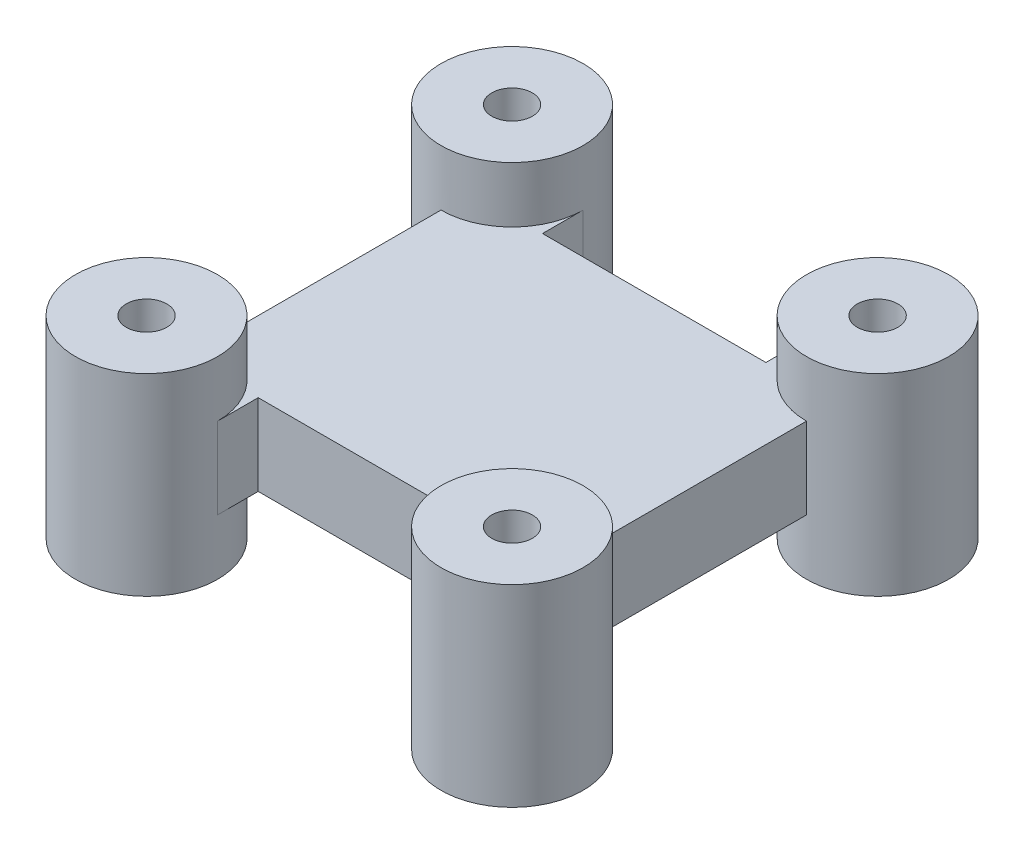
from build123d import *

# Parameters (mm, degrees)
SKETCH1_W           = 22
SKETCH1_H           = 28
BOSS_EXTRUDE1_DEPTH = 8
SKETCH2_R           = 2
CUT_EXTRUDE1_DEPTH  = 37.249137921
SKETCH5_R           = 7
SKETCH5_R_2         = 2
BOSS_EXTRUDE3_DEPTH = 5.5


with BuildPart() as part:
    # Sketch1 → Boss-Extrude1 (new body)
    with BuildSketch(Plane(origin=(0, 0, 0), x_dir=(1, 0, 0), z_dir=(0, 1, 0))):
        with BuildLine():
            ThreePointArc((-18, 11), (-13.050252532, 13.050252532), (-11, 18))
            Line((-11, 18), (-18, 18))
            Line((-18, 18), (-18, 11))
        make_face()
        with BuildLine():
            Line((-18, 18), (-11, 18))
            ThreePointArc((-11, 18), (-22.949747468, 22.949747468), (-18, 11))
            Line((-18, 11), (-18, 18))
        make_face()
        with BuildLine():
            ThreePointArc((-18, 11), (-13.050252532, 13.050252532), (-11, 18))
            Line((-11, 18), (-18, 18))
            Line((-18, 18), (-18, 11))
        make_face()
        with BuildLine():
            Line((-18, 18), (-11, 18))
            ThreePointArc((-11, 18), (-22.949747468, 22.949747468), (-18, 11))
            Line((-18, 11), (-18, 18))
        make_face()
        with BuildLine():
            Line((-11, -18), (-11, -14))
            Line((-11, -14), (-11, 14))
            Line((-11, 14), (-11, 18))
            ThreePointArc((-11, 18), (-13.050252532, 13.050252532), (-18, 11))
            Line((-18, 11), (-18, -11))
            ThreePointArc((-18, -11), (-13.050252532, -13.050252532), (-11, -18))
        make_face()
        with BuildLine():
            ThreePointArc((-18, -11), (-22.949747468, -22.949747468), (-11, -18))
            Line((-11, -18), (-18, -18))
            Line((-18, -18), (-18, -11))
        make_face()
        with BuildLine():
            Line((-18, -18), (-11, -18))
            ThreePointArc((-11, -18), (-13.050252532, -13.050252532), (-18, -11))
            Line((-18, -11), (-18, -18))
        make_face()
        with BuildLine():
            ThreePointArc((-18, -11), (-22.949747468, -22.949747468), (-11, -18))
            Line((-11, -18), (-18, -18))
            Line((-18, -18), (-18, -11))
        make_face()
        with BuildLine():
            Line((-18, -18), (-11, -18))
            ThreePointArc((-11, -18), (-13.050252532, -13.050252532), (-18, -11))
            Line((-18, -11), (-18, -18))
        make_face()
        Rectangle(SKETCH1_W, SKETCH1_H)
        with BuildLine():
            ThreePointArc((18, -11), (13.050252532, -13.050252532), (11, -18))
            Line((11, -18), (18, -18))
            Line((18, -18), (18, -11))
        make_face()
        with BuildLine():
            Line((18, -18), (11, -18))
            ThreePointArc((11, -18), (18, -25), (25, -18))
            ThreePointArc((25, -18), (22.949747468, -13.050252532), (18, -11))
            Line((18, -11), (18, -18))
        make_face()
        with BuildLine():
            Line((11, 14), (11, -14))
            Line((11, -14), (11, -18))
            ThreePointArc((11, -18), (13.050252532, -13.050252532), (18, -11))
            Line((18, -11), (18, 11))
            ThreePointArc((18, 11), (13.050252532, 13.050252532), (11, 18))
            Line((11, 18), (11, 14))
        make_face()
        with BuildLine():
            ThreePointArc((25, 18), (18, 25), (11, 18))
            Line((11, 18), (18, 18))
            Line((18, 18), (18, 11))
            ThreePointArc((18, 11), (22.949747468, 13.050252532), (25, 18))
        make_face()
        with BuildLine():
            Line((18, 18), (11, 18))
            ThreePointArc((11, 18), (13.050252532, 13.050252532), (18, 11))
            Line((18, 11), (18, 18))
        make_face()
        with BuildLine():
            ThreePointArc((25, 18), (18, 25), (11, 18))
            Line((11, 18), (18, 18))
            Line((18, 18), (18, 11))
            ThreePointArc((18, 11), (22.949747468, 13.050252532), (25, 18))
        make_face()
        with BuildLine():
            Line((18, 18), (11, 18))
            ThreePointArc((11, 18), (13.050252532, 13.050252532), (18, 11))
            Line((18, 11), (18, 18))
        make_face()
        with BuildLine():
            ThreePointArc((18, -11), (13.050252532, -13.050252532), (11, -18))
            Line((11, -18), (18, -18))
            Line((18, -18), (18, -11))
        make_face()
        with BuildLine():
            Line((18, -18), (11, -18))
            ThreePointArc((11, -18), (18, -25), (25, -18))
            ThreePointArc((25, -18), (22.949747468, -13.050252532), (18, -11))
            Line((18, -11), (18, -18))
        make_face()
    extrude(amount=BOSS_EXTRUDE1_DEPTH)

    # Sketch2 → Cut-Extrude1 (cut, through all)
    with BuildSketch(Plane(origin=(0, 8, 0), x_dir=(1, 0, 0), z_dir=(0, 1, 0))):
        with Locations(Location((-18, 18, 0), (0, 0, 270))):
            Circle(SKETCH2_R)
        with Locations(Location((-18, -18, 0), (0, 0, 270))):
            Circle(SKETCH2_R)
        with Locations(Location((18, -18, 0), (0, 0, 270))):
            Circle(SKETCH2_R)
        with Locations(Location((18, 18, 0), (0, 0, 270))):
            Circle(SKETCH2_R)
    extrude(amount=-CUT_EXTRUDE1_DEPTH, mode=Mode.SUBTRACT)

    # Sketch5 → Boss-Extrude3 (add)
    # profile 1 of 4: a face of its own
    with BuildSketch(Plane.XZ):
        with Locations(Location((-18, 18, 0), (0, 0, 270))):
            Circle(SKETCH5_R)
        with Locations(Location((-18, 18, 0), (0, 0, 90))):
            Circle(SKETCH5_R_2, mode=Mode.SUBTRACT)
    # profile 2 of 4: a face of its own
    with BuildSketch(Plane.XZ):
        with Locations(Location((18, 18, 0), (0, 0, 270))):
            Circle(SKETCH5_R)
        with Locations(Location((18, 18, 0), (0, 0, 90))):
            Circle(SKETCH5_R_2, mode=Mode.SUBTRACT)
    # profile 3 of 4: a face of its own
    with BuildSketch(Plane.XZ):
        with Locations(Location((18, -18, 0), (0, 0, 270))):
            Circle(SKETCH5_R)
        with Locations(Location((18, -18, 0), (0, 0, 90))):
            Circle(SKETCH5_R_2, mode=Mode.SUBTRACT)
    # profile 4 of 4: a face of its own
    with BuildSketch(Plane.XZ):
        with Locations(Location((-18, -18, 0), (0, 0, 270))):
            Circle(SKETCH5_R)
        with Locations(Location((-18, -18, 0), (0, 0, 90))):
            Circle(SKETCH5_R_2, mode=Mode.SUBTRACT)
    boss_extrude3 = extrude(amount=BOSS_EXTRUDE3_DEPTH)

    # Mirror1: Boss-Extrude3 across plane
    add(boss_extrude3.mirror(Plane.ZX.offset(4)))


solid = part.part
